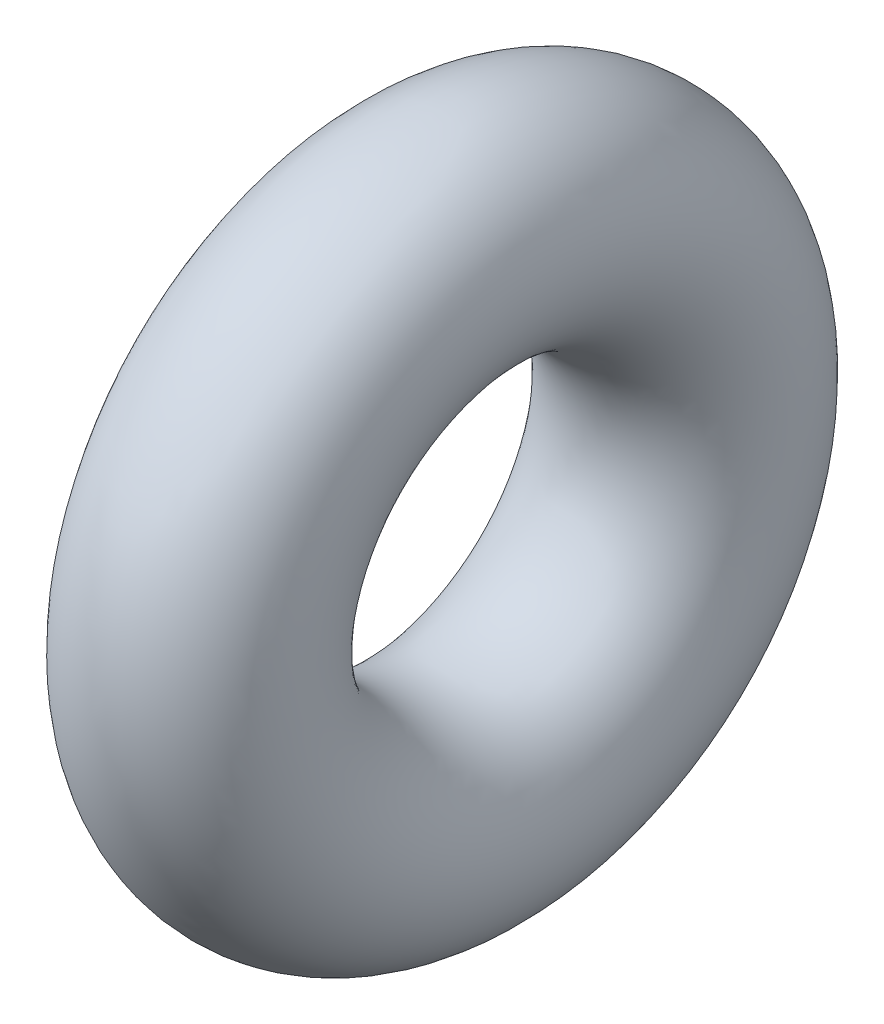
from build123d import *

# Parameters (mm, degrees)
ESQUISSE1_R = 0.6


with BuildPart() as part:
    # Esquisse1 → Base-R_volution (revolve)
    with BuildSketch(Plane.XY, mode=Mode.PRIVATE) as base_r_volution_sk:
        with Locations((2.6, 1.35)):
            Circle(ESQUISSE1_R)
    revolve(base_r_volution_sk.sketch.rotate(Axis((0, 0, 0), (1, 0, 0)), 90), axis=Axis((0, 0, 0), (1, 0, 0)))


solid = part.part
